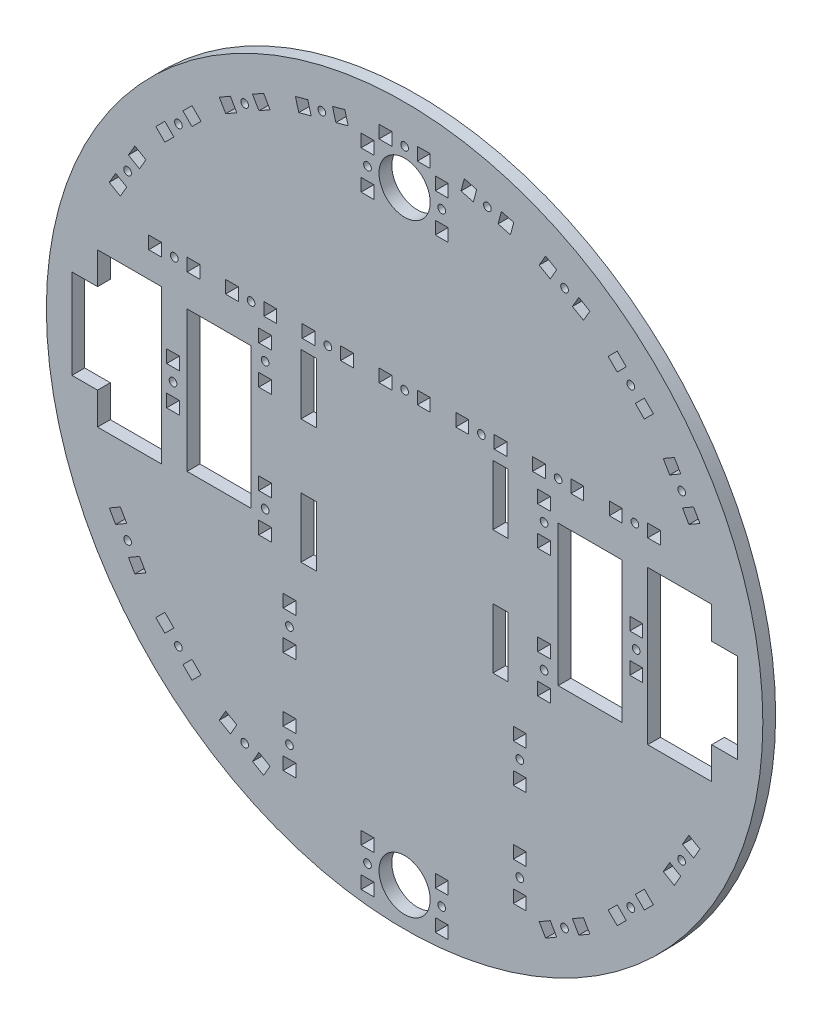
from build123d import *

# Parameters (mm, degrees)
ESQUISSE1_R        = 140
ESQUISSE1_R_2      = 10
ESQUISSE1_R_3      = 1.5
ESQUISSE1_W        = 25
ESQUISSE1_H        = 55
ESQUISSE1_W_2      = 6
ESQUISSE1_H_2      = 23.5
ESQUISSE1_W_3      = 5
ESQUISSE1_H_3      = 5
BOSS_EXTRU_1_DEPTH = 5


with BuildPart() as part:
    # Esquisse1 → Boss.-Extru.1 (new body)
    with BuildSketch(Plane.XY):
        Circle(ESQUISSE1_R)
        with Locations((0, -125)):
            Circle(ESQUISSE1_R_2, mode=Mode.SUBTRACT)
        with Locations(Location((0, 111, 0), (0, 0, 180))):
            Circle(ESQUISSE1_R_2, mode=Mode.SUBTRACT)
        with Locations((54.5, 25)):
            Circle(ESQUISSE1_R_3, mode=Mode.SUBTRACT)
        with Locations(Location((54.5, -25, 0), (0, 0, 90))):
            Circle(ESQUISSE1_R_3, mode=Mode.SUBTRACT)
        with Locations((-54.5, -25)):
            Circle(ESQUISSE1_R_3, mode=Mode.SUBTRACT)
        with Locations(Location((-54.5, 25, 0), (0, 0, 180))):
            Circle(ESQUISSE1_R_3, mode=Mode.SUBTRACT)
        with Locations(Location((45, -60, 0), (0, 0, 90))):
            Circle(ESQUISSE1_R_3, mode=Mode.SUBTRACT)
        with Locations(Location((-45, -60, 0), (0, 0, 270))):
            Circle(ESQUISSE1_R_3, mode=Mode.SUBTRACT)
        with Locations(Location((45, -100, 0), (0, 0, 90))):
            Circle(ESQUISSE1_R_3, mode=Mode.SUBTRACT)
        with Locations((-45, -100)):
            Circle(ESQUISSE1_R_3, mode=Mode.SUBTRACT)
        with Locations((0, 125)):
            Circle(ESQUISSE1_R_3, mode=Mode.SUBTRACT)
        with Locations((32.352380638, 120.740728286)):
            Circle(ESQUISSE1_R_3, mode=Mode.SUBTRACT)
        with Locations((62.5, 108.253175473)):
            Circle(ESQUISSE1_R_3, mode=Mode.SUBTRACT)
        with Locations((88.388347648, 88.388347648)):
            Circle(ESQUISSE1_R_3, mode=Mode.SUBTRACT)
        with Locations((108.253175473, 62.5)):
            Circle(ESQUISSE1_R_3, mode=Mode.SUBTRACT)
        with Locations((108.253175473, -62.5)):
            Circle(ESQUISSE1_R_3, mode=Mode.SUBTRACT)
        with Locations((88.388347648, -88.388347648)):
            Circle(ESQUISSE1_R_3, mode=Mode.SUBTRACT)
        with Locations((62.5, -108.253175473)):
            Circle(ESQUISSE1_R_3, mode=Mode.SUBTRACT)
        with Locations((-62.5, -108.253175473)):
            Circle(ESQUISSE1_R_3, mode=Mode.SUBTRACT)
        with Locations((-88.388347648, -88.388347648)):
            Circle(ESQUISSE1_R_3, mode=Mode.SUBTRACT)
        with Locations((-108.253175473, -62.5)):
            Circle(ESQUISSE1_R_3, mode=Mode.SUBTRACT)
        with Locations((-108.253175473, 62.5)):
            Circle(ESQUISSE1_R_3, mode=Mode.SUBTRACT)
        with Locations((-88.388347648, 88.388347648)):
            Circle(ESQUISSE1_R_3, mode=Mode.SUBTRACT)
        with Locations((-62.5, 108.253175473)):
            Circle(ESQUISSE1_R_3, mode=Mode.SUBTRACT)
        with Locations((-32.352380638, 120.740728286)):
            Circle(ESQUISSE1_R_3, mode=Mode.SUBTRACT)
        with Locations(Location((-90.5, 0, 0), (0, 0, 180))):
            Circle(ESQUISSE1_R_3, mode=Mode.SUBTRACT)
        with Locations((90.5, 0)):
            Circle(ESQUISSE1_R_3, mode=Mode.SUBTRACT)
        with Locations((90, 42.5)):
            Circle(ESQUISSE1_R_3, mode=Mode.SUBTRACT)
        with Locations((0, 42.5)):
            Circle(ESQUISSE1_R_3, mode=Mode.SUBTRACT)
        with Locations((-90, 42.5)):
            Circle(ESQUISSE1_R_3, mode=Mode.SUBTRACT)
        with Locations((30, 42.5)):
            Circle(ESQUISSE1_R_3, mode=Mode.SUBTRACT)
        with Locations((-30, 42.5)):
            Circle(ESQUISSE1_R_3, mode=Mode.SUBTRACT)
        with Locations((-60, 42.5)):
            Circle(ESQUISSE1_R_3, mode=Mode.SUBTRACT)
        with Locations((60, 42.5)):
            Circle(ESQUISSE1_R_3, mode=Mode.SUBTRACT)
        with Locations((14.5, -125)):
            Circle(ESQUISSE1_R_3, mode=Mode.SUBTRACT)
        with Locations(Location((-14.5, -125, 0), (0, 0, 180))):
            Circle(ESQUISSE1_R_3, mode=Mode.SUBTRACT)
        with Locations((-14.5, 111)):
            Circle(ESQUISSE1_R_3, mode=Mode.SUBTRACT)
        with Locations(Location((14.5, 111, 0), (0, 0, 90))):
            Circle(ESQUISSE1_R_3, mode=Mode.SUBTRACT)
        with Locations((-72.5, 0)):
            Rectangle(ESQUISSE1_W, ESQUISSE1_H, mode=Mode.SUBTRACT)
        with Locations((72.5, 0)):
            Rectangle(ESQUISSE1_W, ESQUISSE1_H, mode=Mode.SUBTRACT)
        Polygon((95, 30), (95, -30), (120, -30), (120, -17.5), (130, -17.5), (130, 17.5), (120, 17.5), (120, 30), align=None, mode=Mode.SUBTRACT)
        Polygon((-120, 17.5), (-120, 30), (-95, 30), (-95, -30), (-120, -30), (-120, -17.5), (-130, -17.5), (-130, 17.5), align=None, mode=Mode.SUBTRACT)
        with Locations((37.5, 24.25)):
            Rectangle(ESQUISSE1_W_2, ESQUISSE1_H_2, mode=Mode.SUBTRACT)
        with Locations((-37.5, 24.25)):
            Rectangle(ESQUISSE1_W_2, ESQUISSE1_H_2, mode=Mode.SUBTRACT)
        with Locations((37.5, -24.25)):
            Rectangle(ESQUISSE1_W_2, ESQUISSE1_H_2, mode=Mode.SUBTRACT)
        with Locations((-37.5, -24.25)):
            Rectangle(ESQUISSE1_W_2, ESQUISSE1_H_2, mode=Mode.SUBTRACT)
        with Locations((54.5, 32.5)):
            Rectangle(ESQUISSE1_W_3, ESQUISSE1_H_3, mode=Mode.SUBTRACT)
        with Locations((54.5, 17.5)):
            Rectangle(ESQUISSE1_W_3, ESQUISSE1_H_3, mode=Mode.SUBTRACT)
        with Locations((54.5, -32.5)):
            Rectangle(ESQUISSE1_W_3, ESQUISSE1_H_3, mode=Mode.SUBTRACT)
        with Locations((54.5, -17.5)):
            Rectangle(ESQUISSE1_W_3, ESQUISSE1_H_3, mode=Mode.SUBTRACT)
        with Locations((-54.5, -32.5)):
            Rectangle(ESQUISSE1_W_3, ESQUISSE1_H_3, mode=Mode.SUBTRACT)
        with Locations((-54.5, -17.5)):
            Rectangle(ESQUISSE1_W_3, ESQUISSE1_H_3, mode=Mode.SUBTRACT)
        with Locations((-54.5, 32.5)):
            Rectangle(ESQUISSE1_W_3, ESQUISSE1_H_3, mode=Mode.SUBTRACT)
        with Locations((-54.5, 17.5)):
            Rectangle(ESQUISSE1_W_3, ESQUISSE1_H_3, mode=Mode.SUBTRACT)
        with Locations((45, -67.5)):
            Rectangle(ESQUISSE1_W_3, ESQUISSE1_H_3, mode=Mode.SUBTRACT)
        with Locations((45, -52.5)):
            Rectangle(ESQUISSE1_W_3, ESQUISSE1_H_3, mode=Mode.SUBTRACT)
        with Locations((-45, -67.5)):
            Rectangle(ESQUISSE1_W_3, ESQUISSE1_H_3, mode=Mode.SUBTRACT)
        with Locations((-45, -52.5)):
            Rectangle(ESQUISSE1_W_3, ESQUISSE1_H_3, mode=Mode.SUBTRACT)
        with Locations((45, -92.5)):
            Rectangle(ESQUISSE1_W_3, ESQUISSE1_H_3, mode=Mode.SUBTRACT)
        with Locations((45, -107.5)):
            Rectangle(ESQUISSE1_W_3, ESQUISSE1_H_3, mode=Mode.SUBTRACT)
        with Locations((-45, -107.5)):
            Rectangle(ESQUISSE1_W_3, ESQUISSE1_H_3, mode=Mode.SUBTRACT)
        with Locations((-45, -92.5)):
            Rectangle(ESQUISSE1_W_3, ESQUISSE1_H_3, mode=Mode.SUBTRACT)
        with Locations((-7.5, 125)):
            Rectangle(ESQUISSE1_W_3, ESQUISSE1_H_3, mode=Mode.SUBTRACT)
        with Locations((7.5, 125)):
            Rectangle(ESQUISSE1_W_3, ESQUISSE1_H_3, mode=Mode.SUBTRACT)
        Polygon((28.169799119, 124.449638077), (23.340169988, 125.743733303), (22.046074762, 120.914104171), (26.875703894, 119.620008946), align=None, mode=Mode.SUBTRACT)
        Polygon((37.829057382, 121.861447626), (42.658686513, 120.567352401), (41.364591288, 115.737723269), (36.534962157, 117.031818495), align=None, mode=Mode.SUBTRACT)
        Polygon((59.419872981, 112.918238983), (55.089745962, 115.418238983), (52.589745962, 111.088111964), (56.919872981, 108.588111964), align=None, mode=Mode.SUBTRACT)
        Polygon((68.080127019, 107.918238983), (72.410254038, 105.418238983), (69.910254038, 101.088111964), (65.580127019, 103.588111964), align=None, mode=Mode.SUBTRACT)
        Polygon((86.620580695, 93.691648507), (83.085046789, 97.227182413), (79.549512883, 93.691648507), (83.085046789, 90.156114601), align=None, mode=Mode.SUBTRACT)
        Polygon((93.691648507, 86.620580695), (97.227182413, 83.085046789), (93.691648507, 79.549512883), (90.156114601, 83.085046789), align=None, mode=Mode.SUBTRACT)
        Polygon((107.918238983, 68.080127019), (105.418238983, 72.410254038), (101.088111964, 69.910254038), (103.588111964, 65.580127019), align=None, mode=Mode.SUBTRACT)
        Polygon((112.918238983, 59.419872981), (115.418238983, 55.089745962), (111.088111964, 52.589745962), (108.588111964, 56.919872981), align=None, mode=Mode.SUBTRACT)
        Polygon((112.918238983, -59.419872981), (115.418238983, -55.089745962), (111.088111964, -52.589745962), (108.588111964, -56.919872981), align=None, mode=Mode.SUBTRACT)
        Polygon((107.918238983, -68.080127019), (105.418238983, -72.410254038), (101.088111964, -69.910254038), (103.588111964, -65.580127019), align=None, mode=Mode.SUBTRACT)
        Polygon((93.691648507, -86.620580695), (97.227182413, -83.085046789), (93.691648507, -79.549512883), (90.156114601, -83.085046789), align=None, mode=Mode.SUBTRACT)
        Polygon((86.620580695, -93.691648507), (83.085046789, -97.227182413), (79.549512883, -93.691648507), (83.085046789, -90.156114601), align=None, mode=Mode.SUBTRACT)
        Polygon((68.080127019, -107.918238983), (72.410254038, -105.418238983), (69.910254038, -101.088111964), (65.580127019, -103.588111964), align=None, mode=Mode.SUBTRACT)
        Polygon((59.419872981, -112.918238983), (55.089745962, -115.418238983), (52.589745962, -111.088111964), (56.919872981, -108.588111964), align=None, mode=Mode.SUBTRACT)
        Polygon((-59.419872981, -112.918238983), (-55.089745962, -115.418238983), (-52.589745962, -111.088111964), (-56.919872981, -108.588111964), align=None, mode=Mode.SUBTRACT)
        Polygon((-68.080127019, -107.918238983), (-72.410254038, -105.418238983), (-69.910254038, -101.088111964), (-65.580127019, -103.588111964), align=None, mode=Mode.SUBTRACT)
        Polygon((-86.620580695, -93.691648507), (-83.085046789, -97.227182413), (-79.549512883, -93.691648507), (-83.085046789, -90.156114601), align=None, mode=Mode.SUBTRACT)
        Polygon((-93.691648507, -86.620580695), (-97.227182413, -83.085046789), (-93.691648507, -79.549512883), (-90.156114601, -83.085046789), align=None, mode=Mode.SUBTRACT)
        Polygon((-107.918238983, -68.080127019), (-105.418238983, -72.410254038), (-101.088111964, -69.910254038), (-103.588111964, -65.580127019), align=None, mode=Mode.SUBTRACT)
        Polygon((-112.918238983, -59.419872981), (-115.418238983, -55.089745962), (-111.088111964, -52.589745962), (-108.588111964, -56.919872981), align=None, mode=Mode.SUBTRACT)
        Polygon((-112.918238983, 59.419872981), (-115.418238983, 55.089745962), (-111.088111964, 52.589745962), (-108.588111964, 56.919872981), align=None, mode=Mode.SUBTRACT)
        Polygon((-107.918238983, 68.080127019), (-105.418238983, 72.410254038), (-101.088111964, 69.910254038), (-103.588111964, 65.580127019), align=None, mode=Mode.SUBTRACT)
        Polygon((-93.691648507, 86.620580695), (-97.227182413, 83.085046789), (-93.691648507, 79.549512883), (-90.156114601, 83.085046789), align=None, mode=Mode.SUBTRACT)
        Polygon((-86.620580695, 93.691648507), (-83.085046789, 97.227182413), (-79.549512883, 93.691648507), (-83.085046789, 90.156114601), align=None, mode=Mode.SUBTRACT)
        Polygon((-68.080127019, 107.918238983), (-72.410254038, 105.418238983), (-69.910254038, 101.088111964), (-65.580127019, 103.588111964), align=None, mode=Mode.SUBTRACT)
        Polygon((-59.419872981, 112.918238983), (-55.089745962, 115.418238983), (-52.589745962, 111.088111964), (-56.919872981, 108.588111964), align=None, mode=Mode.SUBTRACT)
        Polygon((-37.829057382, 121.861447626), (-42.658686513, 120.567352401), (-41.364591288, 115.737723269), (-36.534962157, 117.031818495), align=None, mode=Mode.SUBTRACT)
        Polygon((-28.169799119, 124.449638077), (-23.340169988, 125.743733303), (-22.046074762, 120.914104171), (-26.875703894, 119.620008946), align=None, mode=Mode.SUBTRACT)
        with Locations((-90.5, 7.5)):
            Rectangle(ESQUISSE1_W_3, ESQUISSE1_H_3, mode=Mode.SUBTRACT)
        with Locations((-90.5, -7.5)):
            Rectangle(ESQUISSE1_W_3, ESQUISSE1_H_3, mode=Mode.SUBTRACT)
        with Locations((90.5, 7.5)):
            Rectangle(ESQUISSE1_W_3, ESQUISSE1_H_3, mode=Mode.SUBTRACT)
        with Locations((90.5, -7.5)):
            Rectangle(ESQUISSE1_W_3, ESQUISSE1_H_3, mode=Mode.SUBTRACT)
        with Locations((82.5, 42.5)):
            Rectangle(ESQUISSE1_W_3, ESQUISSE1_H_3, mode=Mode.SUBTRACT)
        with Locations((97.5, 42.5)):
            Rectangle(ESQUISSE1_W_3, ESQUISSE1_H_3, mode=Mode.SUBTRACT)
        with Locations((-7.5, 42.5)):
            Rectangle(ESQUISSE1_W_3, ESQUISSE1_H_3, mode=Mode.SUBTRACT)
        with Locations((7.5, 42.5)):
            Rectangle(ESQUISSE1_W_3, ESQUISSE1_H_3, mode=Mode.SUBTRACT)
        with Locations((-97.5, 42.5)):
            Rectangle(ESQUISSE1_W_3, ESQUISSE1_H_3, mode=Mode.SUBTRACT)
        with Locations((-82.5, 42.5)):
            Rectangle(ESQUISSE1_W_3, ESQUISSE1_H_3, mode=Mode.SUBTRACT)
        with Locations((22.5, 42.5)):
            Rectangle(ESQUISSE1_W_3, ESQUISSE1_H_3, mode=Mode.SUBTRACT)
        with Locations((37.5, 42.5)):
            Rectangle(ESQUISSE1_W_3, ESQUISSE1_H_3, mode=Mode.SUBTRACT)
        with Locations((-37.5, 42.5)):
            Rectangle(ESQUISSE1_W_3, ESQUISSE1_H_3, mode=Mode.SUBTRACT)
        with Locations((-22.5, 42.5)):
            Rectangle(ESQUISSE1_W_3, ESQUISSE1_H_3, mode=Mode.SUBTRACT)
        with Locations((-67.5, 42.5)):
            Rectangle(ESQUISSE1_W_3, ESQUISSE1_H_3, mode=Mode.SUBTRACT)
        with Locations((-52.5, 42.5)):
            Rectangle(ESQUISSE1_W_3, ESQUISSE1_H_3, mode=Mode.SUBTRACT)
        with Locations((52.5, 42.5)):
            Rectangle(ESQUISSE1_W_3, ESQUISSE1_H_3, mode=Mode.SUBTRACT)
        with Locations((67.5, 42.5)):
            Rectangle(ESQUISSE1_W_3, ESQUISSE1_H_3, mode=Mode.SUBTRACT)
        with Locations((14.5, -117.5)):
            Rectangle(ESQUISSE1_W_3, ESQUISSE1_H_3, mode=Mode.SUBTRACT)
        with Locations((14.5, -132.5)):
            Rectangle(ESQUISSE1_W_3, ESQUISSE1_H_3, mode=Mode.SUBTRACT)
        with Locations((-14.5, -117.5)):
            Rectangle(ESQUISSE1_W_3, ESQUISSE1_H_3, mode=Mode.SUBTRACT)
        with Locations((-14.5, -132.5)):
            Rectangle(ESQUISSE1_W_3, ESQUISSE1_H_3, mode=Mode.SUBTRACT)
        with Locations((-14.5, 103.5)):
            Rectangle(ESQUISSE1_W_3, ESQUISSE1_H_3, mode=Mode.SUBTRACT)
        with Locations((-14.5, 118.5)):
            Rectangle(ESQUISSE1_W_3, ESQUISSE1_H_3, mode=Mode.SUBTRACT)
        with Locations((14.5, 103.5)):
            Rectangle(ESQUISSE1_W_3, ESQUISSE1_H_3, mode=Mode.SUBTRACT)
        with Locations((14.5, 118.5)):
            Rectangle(ESQUISSE1_W_3, ESQUISSE1_H_3, mode=Mode.SUBTRACT)
    extrude(amount=BOSS_EXTRU_1_DEPTH)


solid = part.part
